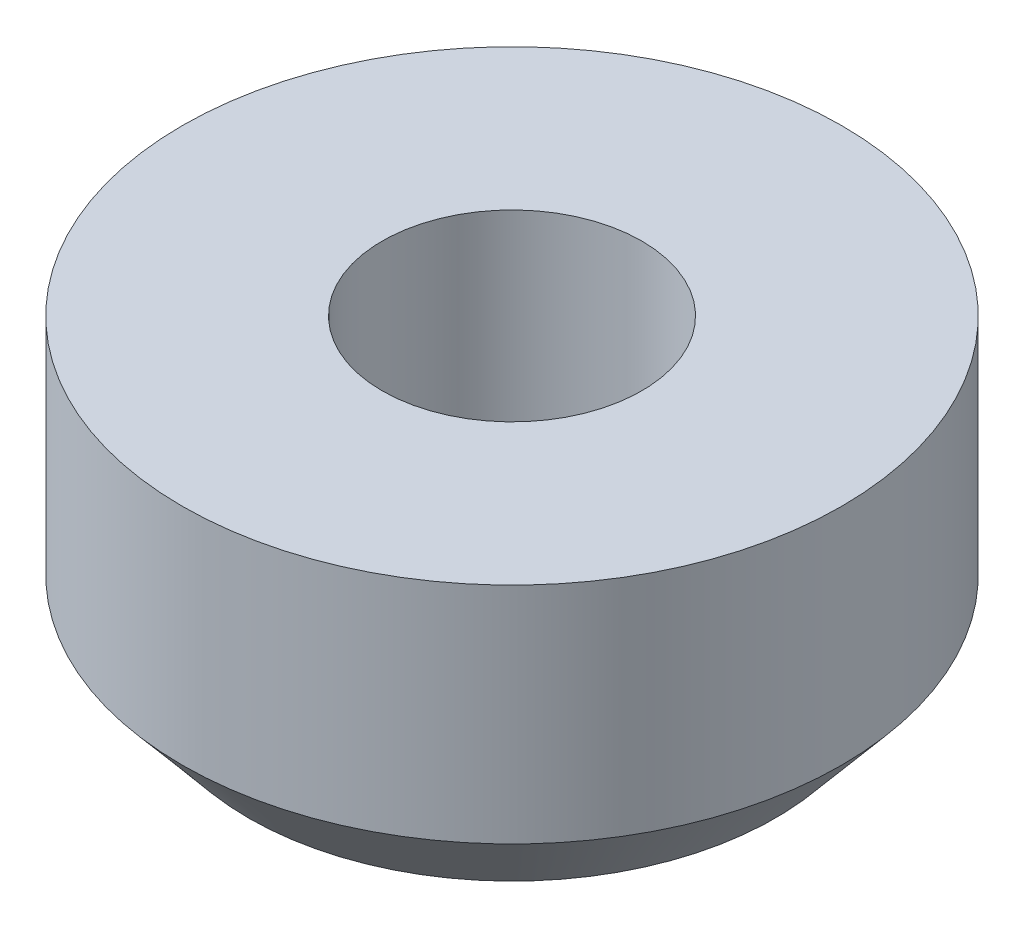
ISO-10303-21;
HEADER;
FILE_DESCRIPTION(('STEP AP214'),'2;1');
FILE_NAME('part.step','',(''),(''),'','','');
FILE_SCHEMA(('AUTOMOTIVE_DESIGN { 1 0 10303 214 1 1 1 1 }'));
ENDSEC;
DATA;
#1=APPLICATION_CONTEXT('core data for automotive mechanical design processes');
#2=APPLICATION_PROTOCOL_DEFINITION('international standard','automotive_design',2000,#1);
#3=PRODUCT_CONTEXT('',#1,'mechanical');
#4=PRODUCT('Part','Part','',(#3));
#5=PRODUCT_RELATED_PRODUCT_CATEGORY('part','',(#4));
#6=PRODUCT_DEFINITION_FORMATION('','',#4);
#7=PRODUCT_DEFINITION_CONTEXT('part definition',#1,'design');
#8=PRODUCT_DEFINITION('design','',#6,#7);
#9=PRODUCT_DEFINITION_SHAPE('','',#8);
#10=(LENGTH_UNIT() NAMED_UNIT(*) SI_UNIT(.MILLI.,.METRE.));
#11=(NAMED_UNIT(*) PLANE_ANGLE_UNIT() SI_UNIT($,.RADIAN.));
#12=(NAMED_UNIT(*) SI_UNIT($,.STERADIAN.) SOLID_ANGLE_UNIT());
#13=UNCERTAINTY_MEASURE_WITH_UNIT(LENGTH_MEASURE(1.E-05),#10,'distance_accuracy_value','');
#14=(GEOMETRIC_REPRESENTATION_CONTEXT(3) GLOBAL_UNCERTAINTY_ASSIGNED_CONTEXT((#13)) GLOBAL_UNIT_ASSIGNED_CONTEXT((#10,
#11,#12)) REPRESENTATION_CONTEXT('',''));
#15=CARTESIAN_POINT('',(0.,0.,0.));
#16=DIRECTION('',(0.,0.,1.));
#17=DIRECTION('',(1.,0.,0.));
#18=AXIS2_PLACEMENT_3D('',#15,#16,#17);
#19=CARTESIAN_POINT('',(0.,2.921,0.));
#20=DIRECTION('',(0.,1.,0.));
#21=DIRECTION('',(0.,0.,1.));
#22=AXIS2_PLACEMENT_3D('',#19,#20,#21);
#23=PLANE('',#22);
#24=CARTESIAN_POINT('',(0.,2.921,0.));
#25=DIRECTION('',(0.,1.,0.));
#26=DIRECTION('',(0.,0.,1.));
#27=AXIS2_PLACEMENT_3D('',#24,#25,#26);
#28=CIRCLE('',#27,6.35);
#29=CARTESIAN_POINT('',(0.,2.921,6.35));
#30=VERTEX_POINT('',#29);
#31=EDGE_CURVE('E52',#30,#30,#28,.T.);
#32=ORIENTED_EDGE('',*,*,#31,.T.);
#33=EDGE_LOOP('',(#32));
#34=FACE_BOUND('',#33,.T.);
#35=CARTESIAN_POINT('',(0.,2.921,0.));
#36=DIRECTION('',(0.,-1.,0.));
#37=DIRECTION('',(0.,0.,-1.));
#38=AXIS2_PLACEMENT_3D('',#35,#36,#37);
#39=CIRCLE('',#38,2.5);
#40=CARTESIAN_POINT('',(0.,2.921,-2.5));
#41=VERTEX_POINT('',#40);
#42=EDGE_CURVE('E58',#41,#41,#39,.T.);
#43=ORIENTED_EDGE('',*,*,#42,.T.);
#44=EDGE_LOOP('',(#43));
#45=FACE_BOUND('',#44,.T.);
#46=ADVANCED_FACE('F38',(#34,#45),#23,.T.);
#47=CARTESIAN_POINT('',(0.,-2.921,0.));
#48=DIRECTION('',(0.,1.,0.));
#49=DIRECTION('',(0.,0.,1.));
#50=AXIS2_PLACEMENT_3D('',#47,#48,#49);
#51=PLANE('',#50);
#52=CARTESIAN_POINT('',(0.,-2.921,0.));
#53=DIRECTION('',(0.,1.,0.));
#54=DIRECTION('',(0.,0.,1.));
#55=AXIS2_PLACEMENT_3D('',#52,#53,#54);
#56=CIRCLE('',#55,5.07121216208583);
#57=CARTESIAN_POINT('',(0.,-2.921,5.07121216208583));
#58=VERTEX_POINT('',#57);
#59=EDGE_CURVE('E10',#58,#58,#56,.F.);
#60=ORIENTED_EDGE('',*,*,#59,.T.);
#61=EDGE_LOOP('',(#60));
#62=FACE_BOUND('',#61,.T.);
#63=CARTESIAN_POINT('',(0.,-2.921,0.));
#64=DIRECTION('',(0.,-1.,0.));
#65=DIRECTION('',(0.,0.,-1.));
#66=AXIS2_PLACEMENT_3D('',#63,#64,#65);
#67=CIRCLE('',#66,2.5);
#68=CARTESIAN_POINT('',(0.,-2.921,-2.5));
#69=VERTEX_POINT('',#68);
#70=EDGE_CURVE('E63',#69,#69,#67,.T.);
#71=ORIENTED_EDGE('',*,*,#70,.F.);
#72=EDGE_LOOP('',(#71));
#73=FACE_BOUND('',#72,.T.);
#74=ADVANCED_FACE('F69',(#62,#73),#51,.F.);
#75=CARTESIAN_POINT('',(0.,2.921,0.));
#76=DIRECTION('',(0.,-1.,0.));
#77=DIRECTION('',(0.,0.,-1.));
#78=AXIS2_PLACEMENT_3D('',#75,#76,#77);
#79=CYLINDRICAL_SURFACE('',#78,6.35);
#80=CARTESIAN_POINT('',(0.,-1.397,0.));
#81=DIRECTION('',(0.,1.,0.));
#82=DIRECTION('',(0.,0.,1.));
#83=AXIS2_PLACEMENT_3D('',#80,#81,#82);
#84=CIRCLE('',#83,6.35);
#85=CARTESIAN_POINT('',(0.,-1.397,6.35));
#86=VERTEX_POINT('',#85);
#87=EDGE_CURVE('E46',#86,#86,#84,.T.);
#88=ORIENTED_EDGE('',*,*,#87,.T.);
#89=EDGE_LOOP('',(#88));
#90=FACE_BOUND('',#89,.T.);
#91=ORIENTED_EDGE('',*,*,#31,.F.);
#92=EDGE_LOOP('',(#91));
#93=FACE_BOUND('',#92,.T.);
#94=ADVANCED_FACE('F71',(#90,#93),#79,.T.);
#95=CARTESIAN_POINT('',(0.,-2.921,0.));
#96=DIRECTION('',(0.,-1.,0.));
#97=DIRECTION('',(0.,0.,-1.));
#98=AXIS2_PLACEMENT_3D('',#95,#96,#97);
#99=CYLINDRICAL_SURFACE('',#98,2.5);
#100=ORIENTED_EDGE('',*,*,#42,.F.);
#101=EDGE_LOOP('',(#100));
#102=FACE_BOUND('',#101,.T.);
#103=ORIENTED_EDGE('',*,*,#70,.T.);
#104=EDGE_LOOP('',(#103));
#105=FACE_BOUND('',#104,.T.);
#106=ADVANCED_FACE('F67',(#102,#105),#99,.F.);
#107=CARTESIAN_POINT('',(0.,-1.397,0.));
#108=DIRECTION('',(0.,1.,0.));
#109=DIRECTION('',(0.,0.,1.));
#110=AXIS2_PLACEMENT_3D('',#107,#108,#109);
#111=CONICAL_SURFACE('',#110,6.35,0.69813170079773);
#112=ORIENTED_EDGE('',*,*,#59,.F.);
#113=EDGE_LOOP('',(#112));
#114=FACE_BOUND('',#113,.T.);
#115=ORIENTED_EDGE('',*,*,#87,.F.);
#116=EDGE_LOOP('',(#115));
#117=FACE_BOUND('',#116,.T.);
#118=ADVANCED_FACE('F40',(#114,#117),#111,.T.);
#119=CLOSED_SHELL('',(#46,#74,#94,#106,#118));
#120=MANIFOLD_SOLID_BREP('B2',#119);
#121=ADVANCED_BREP_SHAPE_REPRESENTATION('',(#18,#120),#14);
#122=SHAPE_DEFINITION_REPRESENTATION(#9,#121);
ENDSEC;
END-ISO-10303-21;
